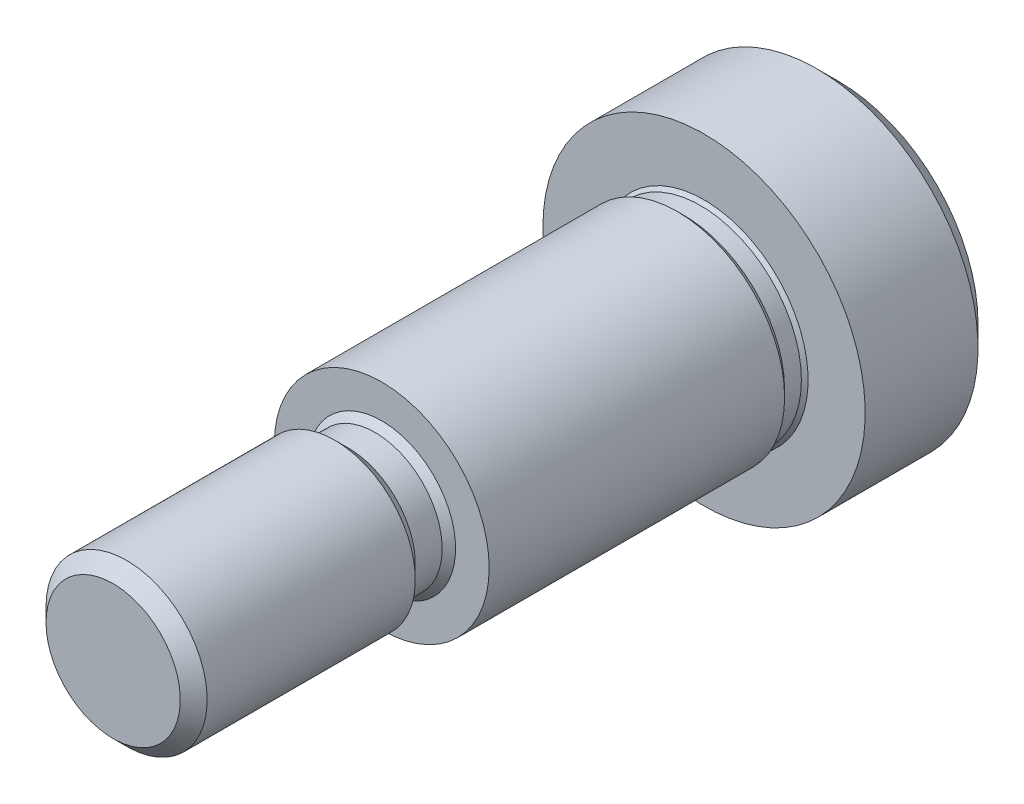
ISO-10303-21;
HEADER;
FILE_DESCRIPTION(('STEP AP214'),'2;1');
FILE_NAME('part.step','',(''),(''),'','','');
FILE_SCHEMA(('AUTOMOTIVE_DESIGN { 1 0 10303 214 1 1 1 1 }'));
ENDSEC;
DATA;
#1=APPLICATION_CONTEXT('core data for automotive mechanical design processes');
#2=APPLICATION_PROTOCOL_DEFINITION('international standard','automotive_design',2000,#1);
#3=PRODUCT_CONTEXT('',#1,'mechanical');
#4=PRODUCT('Part','Part','',(#3));
#5=PRODUCT_RELATED_PRODUCT_CATEGORY('part','',(#4));
#6=PRODUCT_DEFINITION_FORMATION('','',#4);
#7=PRODUCT_DEFINITION_CONTEXT('part definition',#1,'design');
#8=PRODUCT_DEFINITION('design','',#6,#7);
#9=PRODUCT_DEFINITION_SHAPE('','',#8);
#10=(LENGTH_UNIT() NAMED_UNIT(*) SI_UNIT(.MILLI.,.METRE.));
#11=(NAMED_UNIT(*) PLANE_ANGLE_UNIT() SI_UNIT($,.RADIAN.));
#12=(NAMED_UNIT(*) SI_UNIT($,.STERADIAN.) SOLID_ANGLE_UNIT());
#13=UNCERTAINTY_MEASURE_WITH_UNIT(LENGTH_MEASURE(1.E-05),#10,'distance_accuracy_value','');
#14=(GEOMETRIC_REPRESENTATION_CONTEXT(3) GLOBAL_UNCERTAINTY_ASSIGNED_CONTEXT((#13)) GLOBAL_UNIT_ASSIGNED_CONTEXT((#10,
#11,#12)) REPRESENTATION_CONTEXT('',''));
#15=CARTESIAN_POINT('',(0.,0.,0.));
#16=DIRECTION('',(0.,0.,1.));
#17=DIRECTION('',(1.,0.,0.));
#18=AXIS2_PLACEMENT_3D('',#15,#16,#17);
#19=CARTESIAN_POINT('',(0.,0.,-62.352722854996));
#20=DIRECTION('',(0.,0.,-1.));
#21=DIRECTION('',(-1.,0.,0.));
#22=AXIS2_PLACEMENT_3D('',#19,#20,#21);
#23=CYLINDRICAL_SURFACE('',#22,6.35);
#24=CARTESIAN_POINT('',(0.,0.,-17.4625));
#25=DIRECTION('',(0.,0.,-1.));
#26=DIRECTION('',(-1.,0.,0.));
#27=AXIS2_PLACEMENT_3D('',#24,#25,#26);
#28=CIRCLE('',#27,6.35);
#29=CARTESIAN_POINT('',(-6.35000000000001,0.,-17.4625));
#30=VERTEX_POINT('',#29);
#31=EDGE_CURVE('E164',#30,#30,#28,.T.);
#32=ORIENTED_EDGE('',*,*,#31,.F.);
#33=EDGE_LOOP('',(#32));
#34=FACE_BOUND('',#33,.T.);
#35=CARTESIAN_POINT('',(0.,0.,0.));
#36=DIRECTION('',(0.,0.,-1.));
#37=DIRECTION('',(-1.,0.,0.));
#38=AXIS2_PLACEMENT_3D('',#35,#36,#37);
#39=CIRCLE('',#38,6.35);
#40=CARTESIAN_POINT('',(-6.35000000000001,0.,0.));
#41=VERTEX_POINT('',#40);
#42=EDGE_CURVE('E11',#41,#41,#39,.T.);
#43=ORIENTED_EDGE('',*,*,#42,.T.);
#44=EDGE_LOOP('',(#43));
#45=FACE_BOUND('',#44,.T.);
#46=ADVANCED_FACE('F49',(#34,#45),#23,.T.);
#47=CARTESIAN_POINT('',(-6.35000000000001,0.,0.));
#48=DIRECTION('',(0.,0.,-1.));
#49=DIRECTION('',(-1.,0.,0.));
#50=AXIS2_PLACEMENT_3D('',#47,#48,#49);
#51=PLANE('',#50);
#52=ORIENTED_EDGE('',*,*,#42,.F.);
#53=EDGE_LOOP('',(#52));
#54=FACE_BOUND('',#53,.T.);
#55=CARTESIAN_POINT('',(0.,0.,0.));
#56=DIRECTION('',(0.,0.,-1.));
#57=DIRECTION('',(-1.,0.,0.));
#58=AXIS2_PLACEMENT_3D('',#55,#56,#57);
#59=CIRCLE('',#58,4.365625);
#60=CARTESIAN_POINT('',(-4.365625,0.,0.));
#61=VERTEX_POINT('',#60);
#62=EDGE_CURVE('E57',#61,#61,#59,.T.);
#63=ORIENTED_EDGE('',*,*,#62,.T.);
#64=EDGE_LOOP('',(#63));
#65=FACE_BOUND('',#64,.T.);
#66=ADVANCED_FACE('F225',(#54,#65),#51,.F.);
#67=CARTESIAN_POINT('',(0.,0.,0.396875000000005));
#68=DIRECTION('',(0.,0.,-1.));
#69=DIRECTION('',(-1.,0.,0.));
#70=AXIS2_PLACEMENT_3D('',#67,#68,#69);
#71=CONICAL_SURFACE('',#70,3.96875,0.78539816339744);
#72=ORIENTED_EDGE('',*,*,#62,.F.);
#73=EDGE_LOOP('',(#72));
#74=FACE_BOUND('',#73,.T.);
#75=CARTESIAN_POINT('',(0.,0.,0.396875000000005));
#76=DIRECTION('',(0.,0.,-1.));
#77=DIRECTION('',(-1.,0.,0.));
#78=AXIS2_PLACEMENT_3D('',#75,#76,#77);
#79=CIRCLE('',#78,3.96875);
#80=CARTESIAN_POINT('',(-3.96875000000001,0.,0.396875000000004));
#81=VERTEX_POINT('',#80);
#82=EDGE_CURVE('E217',#81,#81,#79,.T.);
#83=ORIENTED_EDGE('',*,*,#82,.T.);
#84=EDGE_LOOP('',(#83));
#85=FACE_BOUND('',#84,.T.);
#86=ADVANCED_FACE('F227',(#74,#85),#71,.T.);
#87=CARTESIAN_POINT('',(0.,0.,-62.352722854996));
#88=DIRECTION('',(0.,0.,-1.));
#89=DIRECTION('',(-1.,0.,0.));
#90=AXIS2_PLACEMENT_3D('',#87,#88,#89);
#91=CYLINDRICAL_SURFACE('',#90,3.96875);
#92=ORIENTED_EDGE('',*,*,#82,.F.);
#93=EDGE_LOOP('',(#92));
#94=FACE_BOUND('',#93,.T.);
#95=CARTESIAN_POINT('',(0.,0.,1.984375));
#96=DIRECTION('',(0.,0.,-1.));
#97=DIRECTION('',(-1.,0.,0.));
#98=AXIS2_PLACEMENT_3D('',#95,#96,#97);
#99=CIRCLE('',#98,3.96875);
#100=CARTESIAN_POINT('',(-3.96875000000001,0.,1.984375));
#101=VERTEX_POINT('',#100);
#102=EDGE_CURVE('E213',#101,#101,#99,.T.);
#103=ORIENTED_EDGE('',*,*,#102,.T.);
#104=EDGE_LOOP('',(#103));
#105=FACE_BOUND('',#104,.T.);
#106=ADVANCED_FACE('F230',(#94,#105),#91,.T.);
#107=CARTESIAN_POINT('',(0.,0.,2.77812500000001));
#108=DIRECTION('',(0.,0.,1.));
#109=DIRECTION('',(1.,0.,0.));
#110=AXIS2_PLACEMENT_3D('',#107,#108,#109);
#111=CONICAL_SURFACE('',#110,4.7625,0.785398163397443);
#112=ORIENTED_EDGE('',*,*,#102,.F.);
#113=EDGE_LOOP('',(#112));
#114=FACE_BOUND('',#113,.T.);
#115=CARTESIAN_POINT('',(0.,0.,2.77812500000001));
#116=DIRECTION('',(0.,0.,-1.));
#117=DIRECTION('',(-1.,0.,0.));
#118=AXIS2_PLACEMENT_3D('',#115,#116,#117);
#119=CIRCLE('',#118,4.7625);
#120=CARTESIAN_POINT('',(-4.76250000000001,0.,2.77812500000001));
#121=VERTEX_POINT('',#120);
#122=EDGE_CURVE('E209',#121,#121,#119,.T.);
#123=ORIENTED_EDGE('',*,*,#122,.T.);
#124=EDGE_LOOP('',(#123));
#125=FACE_BOUND('',#124,.T.);
#126=ADVANCED_FACE('F236',(#114,#125),#111,.T.);
#127=CARTESIAN_POINT('',(0.,0.,-62.352722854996));
#128=DIRECTION('',(0.,0.,-1.));
#129=DIRECTION('',(-1.,0.,0.));
#130=AXIS2_PLACEMENT_3D('',#127,#128,#129);
#131=CYLINDRICAL_SURFACE('',#130,4.7625);
#132=ORIENTED_EDGE('',*,*,#122,.F.);
#133=EDGE_LOOP('',(#132));
#134=FACE_BOUND('',#133,.T.);
#135=CARTESIAN_POINT('',(0.,0.,15.08125));
#136=DIRECTION('',(0.,0.,-1.));
#137=DIRECTION('',(-1.,0.,0.));
#138=AXIS2_PLACEMENT_3D('',#135,#136,#137);
#139=CIRCLE('',#138,4.7625);
#140=CARTESIAN_POINT('',(-4.76250000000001,0.,15.08125));
#141=VERTEX_POINT('',#140);
#142=EDGE_CURVE('E205',#141,#141,#139,.T.);
#143=ORIENTED_EDGE('',*,*,#142,.T.);
#144=EDGE_LOOP('',(#143));
#145=FACE_BOUND('',#144,.T.);
#146=ADVANCED_FACE('F242',(#134,#145),#131,.T.);
#147=CARTESIAN_POINT('',(0.,0.,15.875));
#148=DIRECTION('',(0.,0.,-1.));
#149=DIRECTION('',(-1.,0.,0.));
#150=AXIS2_PLACEMENT_3D('',#147,#148,#149);
#151=CONICAL_SURFACE('',#150,3.96875,0.785398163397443);
#152=ORIENTED_EDGE('',*,*,#142,.F.);
#153=EDGE_LOOP('',(#152));
#154=FACE_BOUND('',#153,.T.);
#155=CARTESIAN_POINT('',(0.,0.,15.875));
#156=DIRECTION('',(0.,0.,-1.));
#157=DIRECTION('',(-1.,0.,0.));
#158=AXIS2_PLACEMENT_3D('',#155,#156,#157);
#159=CIRCLE('',#158,3.96875);
#160=CARTESIAN_POINT('',(-3.96875000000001,0.,15.875));
#161=VERTEX_POINT('',#160);
#162=EDGE_CURVE('E201',#161,#161,#159,.T.);
#163=ORIENTED_EDGE('',*,*,#162,.T.);
#164=EDGE_LOOP('',(#163));
#165=FACE_BOUND('',#164,.T.);
#166=ADVANCED_FACE('F248',(#154,#165),#151,.T.);
#167=CARTESIAN_POINT('',(-3.96875000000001,0.,15.875));
#168=DIRECTION('',(0.,0.,-1.));
#169=DIRECTION('',(-1.,0.,0.));
#170=AXIS2_PLACEMENT_3D('',#167,#168,#169);
#171=PLANE('',#170);
#172=ORIENTED_EDGE('',*,*,#162,.F.);
#173=EDGE_LOOP('',(#172));
#174=FACE_BOUND('',#173,.T.);
#175=ADVANCED_FACE('F254',(#174),#171,.F.);
#176=CARTESIAN_POINT('',(-8.255,0.,-26.9875));
#177=DIRECTION('',(0.,0.,1.));
#178=DIRECTION('',(1.,0.,0.));
#179=AXIS2_PLACEMENT_3D('',#176,#177,#178);
#180=PLANE('',#179);
#181=DIRECTION('',(-0.5,-0.866025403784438,0.));
#182=VECTOR('',#181,1.);
#183=CARTESIAN_POINT('',(3.66617420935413,0.,-26.9875));
#184=LINE('',#183,#182);
#185=CARTESIAN_POINT('',(3.66617420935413,0.,-26.9875));
#186=VERTEX_POINT('',#185);
#187=CARTESIAN_POINT('',(1.83308710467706,-3.175,-26.9875));
#188=VERTEX_POINT('',#187);
#189=EDGE_CURVE('E145',#186,#188,#184,.T.);
#190=ORIENTED_EDGE('',*,*,#189,.F.);
#191=DIRECTION('',(0.499999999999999,-0.866025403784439,0.));
#192=VECTOR('',#191,1.);
#193=CARTESIAN_POINT('',(1.83308710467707,3.175,-26.9875));
#194=LINE('',#193,#192);
#195=CARTESIAN_POINT('',(1.83308710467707,3.175,-26.9875));
#196=VERTEX_POINT('',#195);
#197=EDGE_CURVE('E64',#196,#186,#194,.T.);
#198=ORIENTED_EDGE('',*,*,#197,.F.);
#199=DIRECTION('',(1.,0.,0.));
#200=VECTOR('',#199,1.);
#201=CARTESIAN_POINT('',(-1.83308710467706,3.175,-26.9875));
#202=LINE('',#201,#200);
#203=CARTESIAN_POINT('',(-1.83308710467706,3.175,-26.9875));
#204=VERTEX_POINT('',#203);
#205=EDGE_CURVE('E158',#204,#196,#202,.T.);
#206=ORIENTED_EDGE('',*,*,#205,.F.);
#207=DIRECTION('',(0.5,0.866025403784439,0.));
#208=VECTOR('',#207,1.);
#209=CARTESIAN_POINT('',(-3.66617420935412,0.,-26.9875));
#210=LINE('',#209,#208);
#211=CARTESIAN_POINT('',(-3.66617420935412,0.,-26.9875));
#212=VERTEX_POINT('',#211);
#213=EDGE_CURVE('E155',#212,#204,#210,.T.);
#214=ORIENTED_EDGE('',*,*,#213,.F.);
#215=DIRECTION('',(-0.499999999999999,0.866025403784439,0.));
#216=VECTOR('',#215,1.);
#217=CARTESIAN_POINT('',(-1.83308710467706,-3.175,-26.9875));
#218=LINE('',#217,#216);
#219=CARTESIAN_POINT('',(-1.83308710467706,-3.175,-26.9875));
#220=VERTEX_POINT('',#219);
#221=EDGE_CURVE('E112',#220,#212,#218,.T.);
#222=ORIENTED_EDGE('',*,*,#221,.F.);
#223=DIRECTION('',(-1.,0.,0.));
#224=VECTOR('',#223,1.);
#225=CARTESIAN_POINT('',(1.83308710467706,-3.175,-26.9875));
#226=LINE('',#225,#224);
#227=EDGE_CURVE('E149',#188,#220,#226,.T.);
#228=ORIENTED_EDGE('',*,*,#227,.F.);
#229=EDGE_LOOP('',(#190,#198,#206,#214,#222,#228));
#230=FACE_BOUND('',#229,.T.);
#231=CARTESIAN_POINT('',(0.,0.,-26.9875));
#232=DIRECTION('',(0.,0.,-1.));
#233=DIRECTION('',(-1.,0.,0.));
#234=AXIS2_PLACEMENT_3D('',#231,#232,#233);
#235=CIRCLE('',#234,8.255);
#236=CARTESIAN_POINT('',(-8.255,0.,-26.9875));
#237=VERTEX_POINT('',#236);
#238=EDGE_CURVE('E197',#237,#237,#235,.T.);
#239=ORIENTED_EDGE('',*,*,#238,.T.);
#240=EDGE_LOOP('',(#239));
#241=FACE_BOUND('',#240,.T.);
#242=ADVANCED_FACE('F259',(#230,#241),#180,.F.);
#243=CARTESIAN_POINT('',(0.,0.,-25.7175));
#244=DIRECTION('',(0.,0.,1.));
#245=DIRECTION('',(1.,0.,0.));
#246=AXIS2_PLACEMENT_3D('',#243,#244,#245);
#247=CONICAL_SURFACE('',#246,9.525,0.785398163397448);
#248=ORIENTED_EDGE('',*,*,#238,.F.);
#249=EDGE_LOOP('',(#248));
#250=FACE_BOUND('',#249,.T.);
#251=CARTESIAN_POINT('',(0.,0.,-25.7175));
#252=DIRECTION('',(0.,0.,-1.));
#253=DIRECTION('',(-1.,0.,0.));
#254=AXIS2_PLACEMENT_3D('',#251,#252,#253);
#255=CIRCLE('',#254,9.525);
#256=CARTESIAN_POINT('',(-9.525,0.,-25.7175));
#257=VERTEX_POINT('',#256);
#258=EDGE_CURVE('E193',#257,#257,#255,.T.);
#259=ORIENTED_EDGE('',*,*,#258,.T.);
#260=EDGE_LOOP('',(#259));
#261=FACE_BOUND('',#260,.T.);
#262=ADVANCED_FACE('F266',(#250,#261),#247,.T.);
#263=CARTESIAN_POINT('',(0.,0.,-62.352722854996));
#264=DIRECTION('',(0.,0.,-1.));
#265=DIRECTION('',(-1.,0.,0.));
#266=AXIS2_PLACEMENT_3D('',#263,#264,#265);
#267=CYLINDRICAL_SURFACE('',#266,9.525);
#268=ORIENTED_EDGE('',*,*,#258,.F.);
#269=EDGE_LOOP('',(#268));
#270=FACE_BOUND('',#269,.T.);
#271=CARTESIAN_POINT('',(0.,0.,-19.05));
#272=DIRECTION('',(0.,0.,-1.));
#273=DIRECTION('',(-1.,0.,0.));
#274=AXIS2_PLACEMENT_3D('',#271,#272,#273);
#275=CIRCLE('',#274,9.525);
#276=CARTESIAN_POINT('',(-9.525,0.,-19.05));
#277=VERTEX_POINT('',#276);
#278=EDGE_CURVE('E189',#277,#277,#275,.T.);
#279=ORIENTED_EDGE('',*,*,#278,.T.);
#280=EDGE_LOOP('',(#279));
#281=FACE_BOUND('',#280,.T.);
#282=ADVANCED_FACE('F303',(#270,#281),#267,.T.);
#283=CARTESIAN_POINT('',(-6.15156250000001,0.,-19.05));
#284=DIRECTION('',(0.,0.,-1.));
#285=DIRECTION('',(-1.,0.,0.));
#286=AXIS2_PLACEMENT_3D('',#283,#284,#285);
#287=PLANE('',#286);
#288=ORIENTED_EDGE('',*,*,#278,.F.);
#289=EDGE_LOOP('',(#288));
#290=FACE_BOUND('',#289,.T.);
#291=CARTESIAN_POINT('',(0.,0.,-19.05));
#292=DIRECTION('',(0.,0.,-1.));
#293=DIRECTION('',(-1.,0.,0.));
#294=AXIS2_PLACEMENT_3D('',#291,#292,#293);
#295=CIRCLE('',#294,6.15156250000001);
#296=CARTESIAN_POINT('',(-6.15156250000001,0.,-19.05));
#297=VERTEX_POINT('',#296);
#298=EDGE_CURVE('E185',#297,#297,#295,.T.);
#299=ORIENTED_EDGE('',*,*,#298,.T.);
#300=EDGE_LOOP('',(#299));
#301=FACE_BOUND('',#300,.T.);
#302=ADVANCED_FACE('F299',(#290,#301),#287,.F.);
#303=CARTESIAN_POINT('',(0.,0.,-18.8515625));
#304=DIRECTION('',(0.,0.,-1.));
#305=DIRECTION('',(-1.,0.,0.));
#306=AXIS2_PLACEMENT_3D('',#303,#304,#305);
#307=CONICAL_SURFACE('',#306,5.953125,0.785398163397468);
#308=ORIENTED_EDGE('',*,*,#298,.F.);
#309=EDGE_LOOP('',(#308));
#310=FACE_BOUND('',#309,.T.);
#311=CARTESIAN_POINT('',(0.,0.,-18.8515625));
#312=DIRECTION('',(0.,0.,-1.));
#313=DIRECTION('',(-1.,0.,0.));
#314=AXIS2_PLACEMENT_3D('',#311,#312,#313);
#315=CIRCLE('',#314,5.953125);
#316=CARTESIAN_POINT('',(-5.95312500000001,0.,-18.8515625));
#317=VERTEX_POINT('',#316);
#318=EDGE_CURVE('E181',#317,#317,#315,.T.);
#319=ORIENTED_EDGE('',*,*,#318,.T.);
#320=EDGE_LOOP('',(#319));
#321=FACE_BOUND('',#320,.T.);
#322=ADVANCED_FACE('F291',(#310,#321),#307,.T.);
#323=CARTESIAN_POINT('',(0.,0.,-62.352722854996));
#324=DIRECTION('',(0.,0.,-1.));
#325=DIRECTION('',(-1.,0.,0.));
#326=AXIS2_PLACEMENT_3D('',#323,#324,#325);
#327=CYLINDRICAL_SURFACE('',#326,5.953125);
#328=ORIENTED_EDGE('',*,*,#318,.F.);
#329=EDGE_LOOP('',(#328));
#330=FACE_BOUND('',#329,.T.);
#331=CARTESIAN_POINT('',(0.,0.,-17.859375));
#332=DIRECTION('',(0.,0.,-1.));
#333=DIRECTION('',(-1.,0.,0.));
#334=AXIS2_PLACEMENT_3D('',#331,#332,#333);
#335=CIRCLE('',#334,5.953125);
#336=CARTESIAN_POINT('',(-5.95312500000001,0.,-17.859375));
#337=VERTEX_POINT('',#336);
#338=EDGE_CURVE('E177',#337,#337,#335,.T.);
#339=ORIENTED_EDGE('',*,*,#338,.T.);
#340=EDGE_LOOP('',(#339));
#341=FACE_BOUND('',#340,.T.);
#342=ADVANCED_FACE('F282',(#330,#341),#327,.T.);
#343=CARTESIAN_POINT('',(0.,0.,-17.4625));
#344=DIRECTION('',(0.,0.,1.));
#345=DIRECTION('',(1.,0.,0.));
#346=AXIS2_PLACEMENT_3D('',#343,#344,#345);
#347=CONICAL_SURFACE('',#346,6.35,0.785398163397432);
#348=ORIENTED_EDGE('',*,*,#338,.F.);
#349=EDGE_LOOP('',(#348));
#350=FACE_BOUND('',#349,.T.);
#351=ORIENTED_EDGE('',*,*,#31,.T.);
#352=EDGE_LOOP('',(#351));
#353=FACE_BOUND('',#352,.T.);
#354=ADVANCED_FACE('F279',(#350,#353),#347,.T.);
#355=CARTESIAN_POINT('',(1.83308710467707,3.175,-21.6958333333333));
#356=DIRECTION('',(0.866025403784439,0.499999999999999,0.));
#357=DIRECTION('',(-0.499999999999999,0.866025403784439,0.));
#358=AXIS2_PLACEMENT_3D('',#355,#356,#357);
#359=PLANE('',#358);
#360=ORIENTED_EDGE('',*,*,#197,.T.);
#361=DIRECTION('',(0.,0.,-1.));
#362=VECTOR('',#361,1.);
#363=CARTESIAN_POINT('',(3.66617420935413,0.,-21.6958333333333));
#364=LINE('',#363,#362);
#365=CARTESIAN_POINT('',(3.66617420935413,0.,-21.6958333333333));
#366=VERTEX_POINT('',#365);
#367=EDGE_CURVE('E94',#366,#186,#364,.T.);
#368=ORIENTED_EDGE('',*,*,#367,.F.);
#369=DIRECTION('',(0.499999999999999,-0.866025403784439,0.));
#370=VECTOR('',#369,1.);
#371=CARTESIAN_POINT('',(1.83308710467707,3.175,-21.6958333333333));
#372=LINE('',#371,#370);
#373=CARTESIAN_POINT('',(1.83308710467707,3.175,-21.6958333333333));
#374=VERTEX_POINT('',#373);
#375=EDGE_CURVE('E161',#374,#366,#372,.T.);
#376=ORIENTED_EDGE('',*,*,#375,.F.);
#377=DIRECTION('',(0.,0.,-1.));
#378=VECTOR('',#377,1.);
#379=CARTESIAN_POINT('',(1.83308710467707,3.175,-21.6958333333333));
#380=LINE('',#379,#378);
#381=EDGE_CURVE('E72',#374,#196,#380,.T.);
#382=ORIENTED_EDGE('',*,*,#381,.T.);
#383=EDGE_LOOP('',(#360,#368,#376,#382));
#384=FACE_BOUND('',#383,.T.);
#385=ADVANCED_FACE('F281',(#384),#359,.F.);
#386=CARTESIAN_POINT('',(-1.83308710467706,3.175,-21.6958333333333));
#387=DIRECTION('',(0.,1.,0.));
#388=DIRECTION('',(-1.,0.,0.));
#389=AXIS2_PLACEMENT_3D('',#386,#387,#388);
#390=PLANE('',#389);
#391=ORIENTED_EDGE('',*,*,#205,.T.);
#392=ORIENTED_EDGE('',*,*,#381,.F.);
#393=DIRECTION('',(1.,0.,0.));
#394=VECTOR('',#393,1.);
#395=CARTESIAN_POINT('',(-1.83308710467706,3.175,-21.6958333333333));
#396=LINE('',#395,#394);
#397=CARTESIAN_POINT('',(-1.83308710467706,3.175,-21.6958333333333));
#398=VERTEX_POINT('',#397);
#399=EDGE_CURVE('E126',#398,#374,#396,.T.);
#400=ORIENTED_EDGE('',*,*,#399,.F.);
#401=DIRECTION('',(0.,0.,-1.));
#402=VECTOR('',#401,1.);
#403=CARTESIAN_POINT('',(-1.83308710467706,3.175,-21.6958333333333));
#404=LINE('',#403,#402);
#405=EDGE_CURVE('E117',#398,#204,#404,.T.);
#406=ORIENTED_EDGE('',*,*,#405,.T.);
#407=EDGE_LOOP('',(#391,#392,#400,#406));
#408=FACE_BOUND('',#407,.T.);
#409=ADVANCED_FACE('F289',(#408),#390,.F.);
#410=CARTESIAN_POINT('',(-3.66617420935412,0.,-21.6958333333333));
#411=DIRECTION('',(-0.866025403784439,0.5,0.));
#412=DIRECTION('',(-0.5,-0.866025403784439,0.));
#413=AXIS2_PLACEMENT_3D('',#410,#411,#412);
#414=PLANE('',#413);
#415=ORIENTED_EDGE('',*,*,#213,.T.);
#416=ORIENTED_EDGE('',*,*,#405,.F.);
#417=DIRECTION('',(0.5,0.866025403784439,0.));
#418=VECTOR('',#417,1.);
#419=CARTESIAN_POINT('',(-3.66617420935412,0.,-21.6958333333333));
#420=LINE('',#419,#418);
#421=CARTESIAN_POINT('',(-3.66617420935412,0.,-21.6958333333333));
#422=VERTEX_POINT('',#421);
#423=EDGE_CURVE('E121',#422,#398,#420,.T.);
#424=ORIENTED_EDGE('',*,*,#423,.F.);
#425=DIRECTION('',(0.,0.,-1.));
#426=VECTOR('',#425,1.);
#427=CARTESIAN_POINT('',(-3.66617420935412,0.,-21.6958333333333));
#428=LINE('',#427,#426);
#429=EDGE_CURVE('E105',#422,#212,#428,.T.);
#430=ORIENTED_EDGE('',*,*,#429,.T.);
#431=EDGE_LOOP('',(#415,#416,#424,#430));
#432=FACE_BOUND('',#431,.T.);
#433=ADVANCED_FACE('F122',(#432),#414,.F.);
#434=CARTESIAN_POINT('',(-1.83308710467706,-3.175,-21.6958333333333));
#435=DIRECTION('',(-0.866025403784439,-0.499999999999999,0.));
#436=DIRECTION('',(0.5,-0.866025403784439,0.));
#437=AXIS2_PLACEMENT_3D('',#434,#435,#436);
#438=PLANE('',#437);
#439=ORIENTED_EDGE('',*,*,#221,.T.);
#440=ORIENTED_EDGE('',*,*,#429,.F.);
#441=DIRECTION('',(-0.499999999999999,0.866025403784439,0.));
#442=VECTOR('',#441,1.);
#443=CARTESIAN_POINT('',(-1.83308710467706,-3.175,-21.6958333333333));
#444=LINE('',#443,#442);
#445=CARTESIAN_POINT('',(-1.83308710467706,-3.175,-21.6958333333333));
#446=VERTEX_POINT('',#445);
#447=EDGE_CURVE('E109',#446,#422,#444,.T.);
#448=ORIENTED_EDGE('',*,*,#447,.F.);
#449=DIRECTION('',(0.,0.,-1.));
#450=VECTOR('',#449,1.);
#451=CARTESIAN_POINT('',(-1.83308710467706,-3.175,-21.6958333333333));
#452=LINE('',#451,#450);
#453=EDGE_CURVE('E118',#446,#220,#452,.T.);
#454=ORIENTED_EDGE('',*,*,#453,.T.);
#455=EDGE_LOOP('',(#439,#440,#448,#454));
#456=FACE_BOUND('',#455,.T.);
#457=ADVANCED_FACE('F107',(#456),#438,.F.);
#458=CARTESIAN_POINT('',(1.83308710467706,-3.175,-21.6958333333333));
#459=DIRECTION('',(0.,-1.,0.));
#460=DIRECTION('',(1.,0.,0.));
#461=AXIS2_PLACEMENT_3D('',#458,#459,#460);
#462=PLANE('',#461);
#463=ORIENTED_EDGE('',*,*,#227,.T.);
#464=ORIENTED_EDGE('',*,*,#453,.F.);
#465=DIRECTION('',(-1.,0.,0.));
#466=VECTOR('',#465,1.);
#467=CARTESIAN_POINT('',(1.83308710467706,-3.175,-21.6958333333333));
#468=LINE('',#467,#466);
#469=CARTESIAN_POINT('',(1.83308710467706,-3.175,-21.6958333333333));
#470=VERTEX_POINT('',#469);
#471=EDGE_CURVE('E132',#470,#446,#468,.T.);
#472=ORIENTED_EDGE('',*,*,#471,.F.);
#473=DIRECTION('',(0.,0.,-1.));
#474=VECTOR('',#473,1.);
#475=CARTESIAN_POINT('',(1.83308710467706,-3.175,-21.6958333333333));
#476=LINE('',#475,#474);
#477=EDGE_CURVE('E169',#470,#188,#476,.T.);
#478=ORIENTED_EDGE('',*,*,#477,.T.);
#479=EDGE_LOOP('',(#463,#464,#472,#478));
#480=FACE_BOUND('',#479,.T.);
#481=ADVANCED_FACE('F386',(#480),#462,.F.);
#482=CARTESIAN_POINT('',(3.66617420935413,0.,-21.6958333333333));
#483=DIRECTION('',(0.866025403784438,-0.5,0.));
#484=DIRECTION('',(0.5,0.866025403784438,0.));
#485=AXIS2_PLACEMENT_3D('',#482,#483,#484);
#486=PLANE('',#485);
#487=ORIENTED_EDGE('',*,*,#189,.T.);
#488=ORIENTED_EDGE('',*,*,#477,.F.);
#489=DIRECTION('',(-0.5,-0.866025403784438,0.));
#490=VECTOR('',#489,1.);
#491=CARTESIAN_POINT('',(3.66617420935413,0.,-21.6958333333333));
#492=LINE('',#491,#490);
#493=EDGE_CURVE('E137',#366,#470,#492,.T.);
#494=ORIENTED_EDGE('',*,*,#493,.F.);
#495=ORIENTED_EDGE('',*,*,#367,.T.);
#496=EDGE_LOOP('',(#487,#488,#494,#495));
#497=FACE_BOUND('',#496,.T.);
#498=ADVANCED_FACE('F397',(#497),#486,.F.);
#499=CARTESIAN_POINT('',(1.83308710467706,3.175,-21.6958333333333));
#500=DIRECTION('',(0.,0.,1.));
#501=DIRECTION('',(1.,0.,0.));
#502=AXIS2_PLACEMENT_3D('',#499,#500,#501);
#503=PLANE('',#502);
#504=ORIENTED_EDGE('',*,*,#375,.T.);
#505=ORIENTED_EDGE('',*,*,#493,.T.);
#506=ORIENTED_EDGE('',*,*,#471,.T.);
#507=ORIENTED_EDGE('',*,*,#447,.T.);
#508=ORIENTED_EDGE('',*,*,#423,.T.);
#509=ORIENTED_EDGE('',*,*,#399,.T.);
#510=EDGE_LOOP('',(#504,#505,#506,#507,#508,#509));
#511=FACE_BOUND('',#510,.T.);
#512=ADVANCED_FACE('F129',(#511),#503,.F.);
#513=CLOSED_SHELL('',(#46,#66,#86,#106,#126,#146,#166,#175,#242,#262,#282,#302,#322,#342,#354,
#385,#409,#433,#457,#481,#498,#512));
#514=MANIFOLD_SOLID_BREP('B2',#513);
#515=ADVANCED_BREP_SHAPE_REPRESENTATION('',(#18,#514),#14);
#516=SHAPE_DEFINITION_REPRESENTATION(#9,#515);
ENDSEC;
END-ISO-10303-21;
